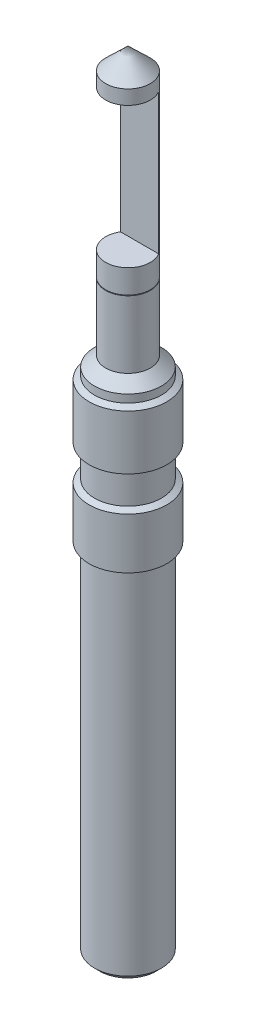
from build123d import *

# Parameters (mm, degrees)
CHAMFER1_SIZE = 0.762
SKETCH2_W     = 0.324987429
SKETCH2_H     = 0.088132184
SKETCH4_W     = 6.35
SKETCH4_H     = 20
NOTCH_DEPTH   = 113.379464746


with BuildPart() as part:
    # Sketch1 → Base-Revolve (revolve)
    with BuildSketch(Plane.XY, mode=Mode.PRIVATE) as base_revolve_sk:
        Polygon((0, 0), (-3.175, -3.048), (-3.175, -38.1), (-4.7625, -39.5224), (-4.7625, -40.64), (-5.5245, -41.079940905), (-5.5245, -48.836059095), (-4.7625, -49.276), (-4.7625, -53.34), (-5.5245, -53.779940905), (-5.5245, -61.027890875), (-4.7625, -61.46783178), (-4.7625, -112.014), (0, -112.014), align=None)
    revolve(base_revolve_sk.sketch.rotate(Axis((0, 13.089101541, 0), (0, -1, 0)), 270), axis=Axis((0, 13.089101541, 0), (0, -1, 0)))

    # Chamfer1
    chamfer1_edges = [part.edges().sort_by_distance(p)[0] for p in [
        (0, -112.014, -4.7625),
    ]]
    chamfer(chamfer1_edges, length=CHAMFER1_SIZE)

    # Sketch2 → tip join line (revolve, cut)
    with BuildSketch(Plane.XY, mode=Mode.PRIVATE) as tip_join_line_sk:
        with Locations((-3.098274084, -28.492066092)):
            Rectangle(SKETCH2_W, SKETCH2_H)
    revolve(tip_join_line_sk.sketch.rotate(Axis((0, -16.914637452, 0), (0, -1, 0)), 270), axis=Axis((0, -16.914637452, 0), (0, -1, 0)), mode=Mode.SUBTRACT)

    # Sketch4 → notch (cut, through all)
    with BuildSketch(Plane.XY.offset(-1.651)):
        with Locations((0, -15.08)):
            Rectangle(SKETCH4_W, SKETCH4_H)
    extrude(amount=NOTCH_DEPTH, mode=Mode.SUBTRACT)


solid = part.part
